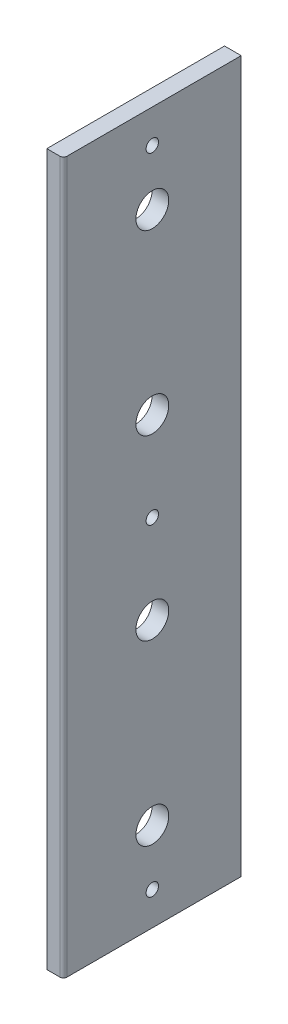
from build123d import *

# Parameters (mm, degrees)
SKETCH1_W           = 50.8
SKETCH1_H           = 203.2
SKETCH1_R           = 4.699
BOSS_EXTRUDE1_DEPTH = 4.7625
SKETCH1_3_R         = 4.699
CUT_EXTRUDE2_DEPTH  = 180.668253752
SKETCH2_R           = 1.778
CUT_EXTRUDE3_DEPTH  = 180.668253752
FILLET1_R           = 1.000000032


with BuildPart() as part:
    # Sketch1 → Boss-Extrude1 (new body)
    # profile 1 of 5: a face of its own
    with BuildSketch(Plane(origin=(0, 0, 0), x_dir=(0, 0, -1), z_dir=(1, 0, 0))):
        with Locations((0, 76.2)):
            Rectangle(SKETCH1_W, SKETCH1_H)
        Circle(SKETCH1_R, mode=Mode.SUBTRACT)
        with Locations((0, 50.8)):
            Circle(SKETCH1_R, mode=Mode.SUBTRACT)
        with Locations((0, 101.6)):
            Circle(SKETCH1_R, mode=Mode.SUBTRACT)
        with Locations((0, 152.4)):
            Circle(SKETCH1_R, mode=Mode.SUBTRACT)
    # profile 2 of 5: a face of its own
    with BuildSketch(Plane(origin=(0, 0, 0), x_dir=(0, 0, -1), z_dir=(1, 0, 0))):
        with Locations((0, 101.6)):
            Circle(SKETCH1_R)
    # profile 3 of 5: a face of its own
    with BuildSketch(Plane(origin=(0, 0, 0), x_dir=(0, 0, -1), z_dir=(1, 0, 0))):
        with Locations((0, 152.4)):
            Circle(SKETCH1_R)
    # profile 4 of 5: a face of its own
    with BuildSketch(Plane(origin=(0, 0, 0), x_dir=(0, 0, -1), z_dir=(1, 0, 0))):
        with Locations((0, 50.8)):
            Circle(SKETCH1_R)
    # profile 5 of 5: a face of its own
    with BuildSketch(Plane(origin=(0, 0, 0), x_dir=(0, 0, -1), z_dir=(1, 0, 0))):
        Circle(SKETCH1_R)
    extrude(amount=BOSS_EXTRUDE1_DEPTH)

    # Sketch1_3 → Cut-Extrude2 (cut, through all)
    with BuildSketch(Plane(origin=(0, 0, 0), x_dir=(0, 0, -1), z_dir=(1, 0, 0))):
        with Locations(Location((0, 152.4, 0), (0, 0, 180))):
            Circle(SKETCH1_3_R)
        with Locations(Location((0, 101.6, 0), (0, 0, 180))):
            Circle(SKETCH1_3_R)
        with Locations(Location((0, 50.8, 0), (0, 0, 180))):
            Circle(SKETCH1_3_R)
        with Locations(Location((0, 0, 0), (0, 0, 180))):
            Circle(SKETCH1_3_R)
    extrude(amount=CUT_EXTRUDE2_DEPTH, mode=Mode.SUBTRACT)

    # Sketch2 → Cut-Extrude3 (cut, through all)
    with BuildSketch(Plane(origin=(4.7625, 0, 0), x_dir=(0, 0, -1), z_dir=(1, 0, 0))):
        with Locations((0, 76.2)):
            Circle(SKETCH2_R)
        with Locations((0, 168.275)):
            Circle(SKETCH2_R)
        with Locations((0, -15.875)):
            Circle(SKETCH2_R)
    extrude(amount=-CUT_EXTRUDE3_DEPTH, mode=Mode.SUBTRACT)

    # Fillet1
    fillet1_edges = [part.edges().sort_by_distance(p)[0] for p in [
        (4.7625, 76.2, 25.4),
    ]]
    fillet(fillet1_edges, radius=FILLET1_R)


solid = part.part
